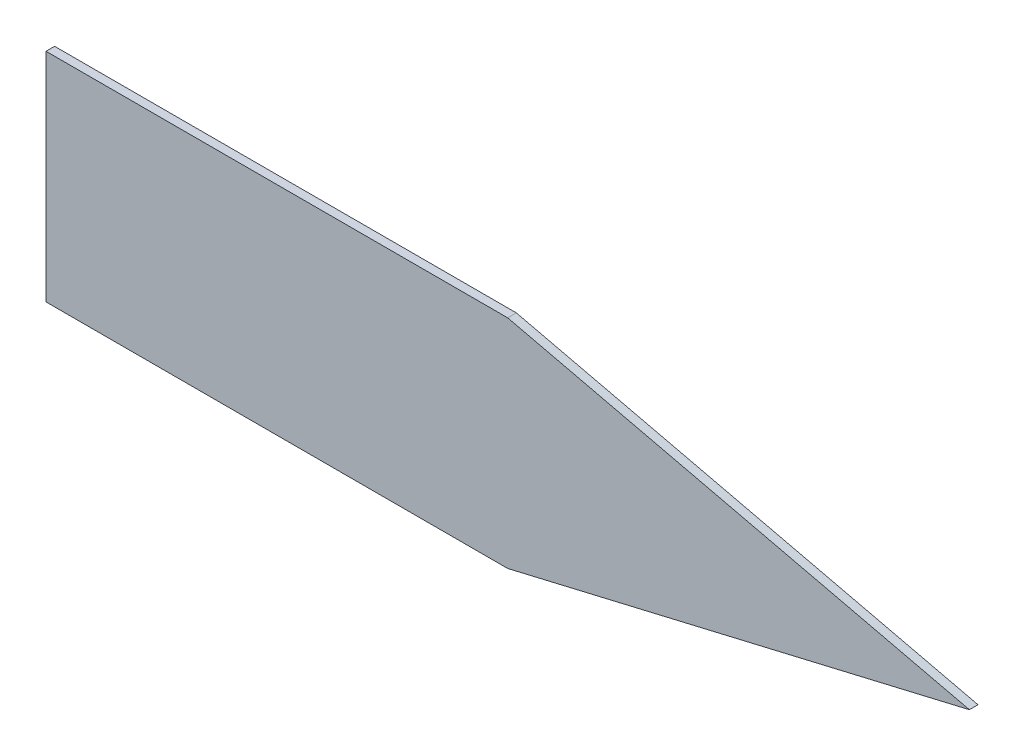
from build123d import *

# Parameters (mm, degrees)
AUFSATZ_LINEAR_AUSTRAGEN1_DEPTH = 0.5


with BuildPart() as part:
    # Skizze1 → Aufsatz-Linear austragen1 (new, symmetric)
    with BuildSketch(Plane.XY):
        Polygon((53.598526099, 0), (0, 12.600607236), (-53.598526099, 12.600607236), (-53.598526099, -12.600607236), (0, -12.600607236), align=None)
    extrude(amount=AUFSATZ_LINEAR_AUSTRAGEN1_DEPTH, both=True)


solid = part.part
